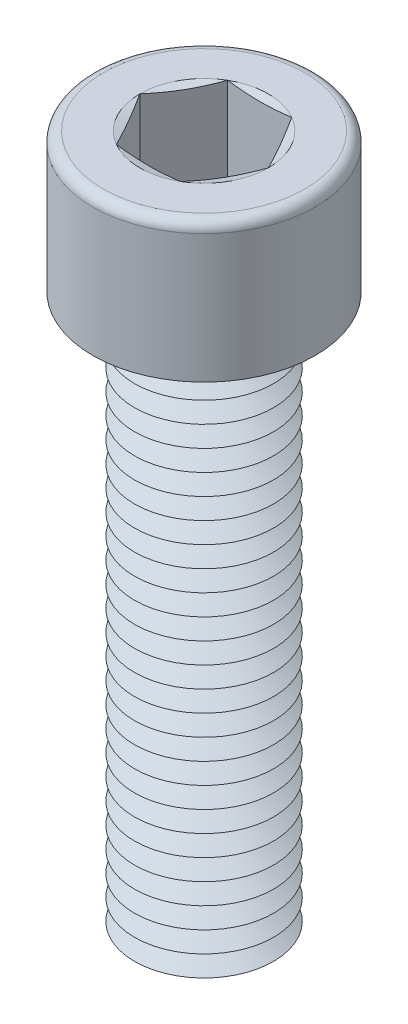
from build123d import *

# Parameters (mm, degrees)
SKETCH1_R       = 5
EXTRUDE1_DEPTH  = 40
SKETCH2_R       = 8
EXTRUDE2_DEPTH  = 10
EXTRUDE3_DEPTH  = 8
FILLET1_R       = 0.75
LPATTERN1_COUNT = 27
LPATTERN1_PITCH = 1.5


with BuildPart() as part:
    # Sketch1 → Extrude1 (new body)
    with BuildSketch(Plane(origin=(0, 0, 0), x_dir=(1, 0, 0), z_dir=(0, 1, 0))):
        with Locations(Location((0, 0, 0), (0, 0, 270))):
            Circle(SKETCH1_R)
    extrude(amount=EXTRUDE1_DEPTH)

    # Sketch2 → Extrude2 (add)
    with BuildSketch(Plane(origin=(0, 40, 0), x_dir=(1, 0, 0), z_dir=(0, 1, 0))):
        with Locations(Location((0, 0, 0), (0, 0, 270))):
            Circle(SKETCH2_R)
    extrude(amount=EXTRUDE2_DEPTH)

    # Sketch3 → Extrude3 (cut)
    with BuildSketch(Plane(origin=(0, 50, 0), x_dir=(1, 0, 0), z_dir=(0, 1, 0))):
        Polygon((2.309401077, 4), (-2.309401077, 4), (-4.618802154, 0), (-2.309401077, -4), (2.309401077, -4), (4.618802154, 0), align=None)
    extrude(amount=-EXTRUDE3_DEPTH, mode=Mode.SUBTRACT)

    # Fillet1
    fillet1_edges = [part.edges().sort_by_distance(p)[0] for p in [
        (0, 50, -8),
    ]]
    fillet(fillet1_edges, radius=FILLET1_R)

    # Sketch4 → Cut-Revolve1 (revolve, cut)
    with BuildSketch(Plane(origin=(0, 0, 0), x_dir=(0, 0, -1), z_dir=(1, 0, 0))):
        Polygon((-4, 42), (0, 42), (0, 39.690598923), align=None)
    revolve(axis=Axis((0, 42, 0), (0, -1, 0)), mode=Mode.SUBTRACT)

    # Sketch5 → Cut-Revolve2 (revolve, cut)
    with BuildSketch(Plane.XY, mode=Mode.PRIVATE) as cut_revolve2_sk:
        Polygon((-5, 0.75), (-5, -0.75), (-3.700961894, 0), align=None)
    cut_revolve2 = revolve(cut_revolve2_sk.sketch.rotate(Axis((0, 40, 0), (0, -1, 0)), 270), axis=Axis((0, 40, 0), (0, -1, 0)), mode=Mode.SUBTRACT)

    # LPattern1: Cut-Revolve2 ×27
    with Locations(*[(0, i * LPATTERN1_PITCH, 0) for i in range(1, LPATTERN1_COUNT)]):
        add(cut_revolve2, mode=Mode.SUBTRACT)

    # Extrude4 cone 1 section (on through the dimple's axis) → Extrude4 (revolve, cut)
    with BuildSketch(Plane(origin=(0, 50, 0), x_dir=(0, 0, 1), z_dir=(1, 0, 0))):
        Polygon((0, 0), (4.618802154, 0), (0, 1.237604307), align=None)
    revolve(axis=Axis((0, 50, 0), (0, -1, 0)), mode=Mode.SUBTRACT)


solid = part.part
